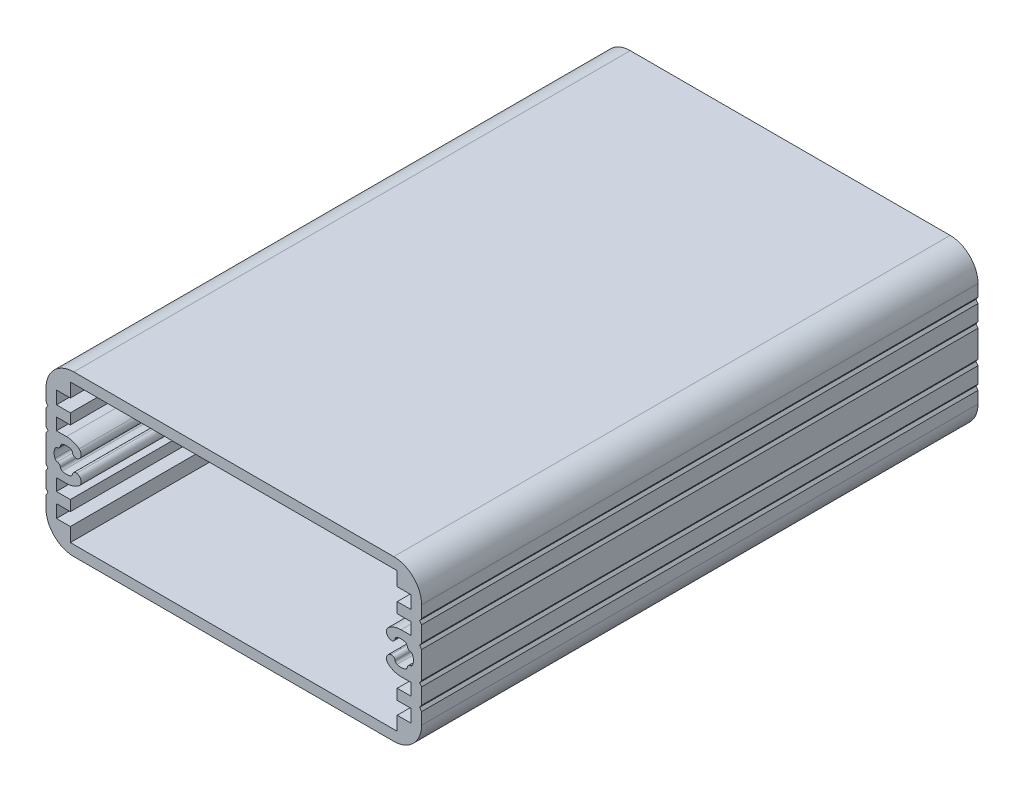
from build123d import *

# Parameters (mm, degrees)
BOSS_EXTRUDE1_DEPTH = 80


with BuildPart() as part:
    # Sketch1 → Boss-Extrude1 (new body)
    with BuildSketch(Plane.XY.offset(40)):
        with BuildLine():
            Line((27, 5.7977), (27, 7.5))
            ThreePointArc((27, 7.5), (25.828427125, 10.328427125), (23, 11.5))
            Line((23, 11.5), (-23, 11.5))
            ThreePointArc((-23, 11.5), (-25.828427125, 10.328427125), (-27, 7.5))
            Line((-27, 7.5), (-27, 5.7977))
            Line((-27, 5.7977), (-26.7206, 5.404))
            Line((-26.7206, 5.404), (-27, 5.0103))
            Line((-27, 5.0103), (-27, 2.7243))
            Line((-27, 2.7243), (-26.7206, 2.3306))
            Line((-26.7206, 2.3306), (-27, 1.9369))
            Line((-27, 1.9369), (-27, -1.9369))
            Line((-27, -1.9369), (-26.7206, -2.3306))
            Line((-26.7206, -2.3306), (-27, -2.7243))
            Line((-27, -2.7243), (-27, -5.0103))
            Line((-27, -5.0103), (-26.7206, -5.404))
            Line((-26.7206, -5.404), (-27, -5.7977))
            Line((-27, -5.7977), (-27, -7.5))
            ThreePointArc((-27, -7.5), (-25.828427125, -10.328427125), (-23, -11.5))
            Line((-23, -11.5), (23, -11.5))
            ThreePointArc((23, -11.5), (25.828427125, -10.328427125), (27, -7.5))
            Line((27, -7.5), (27, -5.7977))
            Line((27, -5.7977), (26.7206, -5.404))
            Line((26.7206, -5.404), (27, -5.0103))
            Line((27, -5.0103), (27, -2.7243))
            Line((27, -2.7243), (26.7206, -2.3306))
            Line((26.7206, -2.3306), (27, -1.9369))
            Line((27, -1.9369), (27, 1.9369))
            Line((27, 1.9369), (26.7206, 2.3306))
            Line((26.7206, 2.3306), (27, 2.7243))
            Line((27, 2.7243), (27, 5.0103))
            Line((27, 5.0103), (26.7206, 5.404))
            Line((26.7206, 5.404), (27, 5.7977))
        make_face()
        with BuildLine():
            Line((-24.05, 2.92), (-25.5, 2.92))
            Line((-25.5, 2.92), (-25.5, 4.64))
            Line((-25.5, 4.64), (-23.5, 4.64))
            Line((-23.5, 4.64), (-23.5, 6.15))
            Line((-23.5, 6.15), (-25.5, 6.15))
            Line((-25.5, 6.15), (-25.5, 8))
            Line((-25.5, 8), (-23.5, 8))
            Line((-23.5, 8), (-23.5, 10))
            Line((-23.5, 10), (23.5, 10))
            Line((23.5, 10), (23.5, 8))
            Line((23.5, 8), (25.5, 8))
            Line((25.5, 8), (25.5, 6.15))
            Line((25.5, 6.15), (23.5, 6.15))
            Line((23.5, 6.15), (23.5, 4.64))
            Line((23.5, 4.64), (25.5, 4.64))
            Line((25.5, 4.64), (25.5, 2.92))
            Line((25.5, 2.92), (24.05, 2.92))
            ThreePointArc((24.05, 2.92), (23.093756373, 2.758984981), (22.242971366, 2.293697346))
            ThreePointArc((22.242971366, 2.293697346), (21.969426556, 1.48996164), (22.591861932, 0.912560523))
            ThreePointArc((22.591861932, 0.912560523), (22.97773428, 1.00139606), (23.183740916, 1.339553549))
            ThreePointArc((23.183740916, 1.339553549), (23.278266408, 1.550730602), (23.468546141, 1.682352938))
            ThreePointArc((23.468546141, 1.682352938), (24.064168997, 1.779943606), (24.658162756, 1.672883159))
            ThreePointArc((24.658162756, 1.672883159), (24.846322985, 1.538248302), (24.937474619, 1.325593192))
            ThreePointArc((24.937474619, 1.325593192), (25.082375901, 1.032375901), (25.375593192, 0.887474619))
            ThreePointArc((25.375593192, 0.887474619), (25.588248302, 0.796322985), (25.722883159, 0.608162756))
            ThreePointArc((25.722883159, 0.608162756), (25.83, 0), (25.722883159, -0.608162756))
            ThreePointArc((25.722883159, -0.608162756), (25.588248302, -0.796322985), (25.375593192, -0.887474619))
            ThreePointArc((25.375593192, -0.887474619), (25.082375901, -1.032375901), (24.937474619, -1.325593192))
            ThreePointArc((24.937474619, -1.325593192), (24.846322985, -1.538248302), (24.658162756, -1.672883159))
            ThreePointArc((24.658162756, -1.672883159), (24.064168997, -1.779943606), (23.468546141, -1.682352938))
            ThreePointArc((23.468546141, -1.682352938), (23.278266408, -1.550730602), (23.183740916, -1.339553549))
            ThreePointArc((23.183740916, -1.339553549), (22.97773428, -1.00139606), (22.591861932, -0.912560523))
            ThreePointArc((22.591861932, -0.912560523), (21.969426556, -1.48996164), (22.242971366, -2.293697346))
            ThreePointArc((22.242971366, -2.293697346), (23.093756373, -2.758984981), (24.05, -2.92))
            Line((24.05, -2.92), (25.5, -2.92))
            Line((25.5, -2.92), (25.5, -4.64))
            Line((25.5, -4.64), (23.5, -4.64))
            Line((23.5, -4.64), (23.5, -6.15))
            Line((23.5, -6.15), (25.5, -6.15))
            Line((25.5, -6.15), (25.5, -8))
            Line((25.5, -8), (23.5, -8))
            Line((23.5, -8), (23.5, -10))
            Line((23.5, -10), (-23.5, -10))
            Line((-23.5, -10), (-23.5, -8))
            Line((-23.5, -8), (-25.5, -8))
            Line((-25.5, -8), (-25.5, -6.15))
            Line((-25.5, -6.15), (-23.5, -6.15))
            Line((-23.5, -6.15), (-23.5, -4.64))
            Line((-23.5, -4.64), (-25.5, -4.64))
            Line((-25.5, -4.64), (-25.5, -2.92))
            Line((-25.5, -2.92), (-24.05, -2.92))
            ThreePointArc((-24.05, -2.92), (-23.093756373, -2.758984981), (-22.242971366, -2.293697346))
            ThreePointArc((-22.242971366, -2.293697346), (-21.969426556, -1.48996164), (-22.591861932, -0.912560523))
            ThreePointArc((-22.591861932, -0.912560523), (-22.97773428, -1.00139606), (-23.183740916, -1.339553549))
            ThreePointArc((-23.183740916, -1.339553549), (-23.278266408, -1.550730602), (-23.468546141, -1.682352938))
            ThreePointArc((-23.468546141, -1.682352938), (-24.064168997, -1.779943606), (-24.658162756, -1.672883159))
            ThreePointArc((-24.658162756, -1.672883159), (-24.846322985, -1.538248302), (-24.937474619, -1.325593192))
            ThreePointArc((-24.937474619, -1.325593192), (-25.082375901, -1.032375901), (-25.375593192, -0.887474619))
            ThreePointArc((-25.375593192, -0.887474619), (-25.588248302, -0.796322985), (-25.722883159, -0.608162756))
            ThreePointArc((-25.722883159, -0.608162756), (-25.83, 0), (-25.722883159, 0.608162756))
            ThreePointArc((-25.722883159, 0.608162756), (-25.588248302, 0.796322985), (-25.375593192, 0.887474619))
            ThreePointArc((-25.375593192, 0.887474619), (-25.082375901, 1.032375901), (-24.937474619, 1.325593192))
            ThreePointArc((-24.937474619, 1.325593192), (-24.846322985, 1.538248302), (-24.658162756, 1.672883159))
            ThreePointArc((-24.658162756, 1.672883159), (-24.064168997, 1.779943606), (-23.468546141, 1.682352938))
            ThreePointArc((-23.468546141, 1.682352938), (-23.278266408, 1.550730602), (-23.183740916, 1.339553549))
            ThreePointArc((-23.183740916, 1.339553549), (-22.97773428, 1.00139606), (-22.591861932, 0.912560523))
            ThreePointArc((-22.591861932, 0.912560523), (-21.969426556, 1.48996164), (-22.242971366, 2.293697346))
            ThreePointArc((-22.242971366, 2.293697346), (-23.093756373, 2.758984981), (-24.05, 2.92))
        make_face(mode=Mode.SUBTRACT)
    extrude(amount=-BOSS_EXTRUDE1_DEPTH)


solid = part.part
